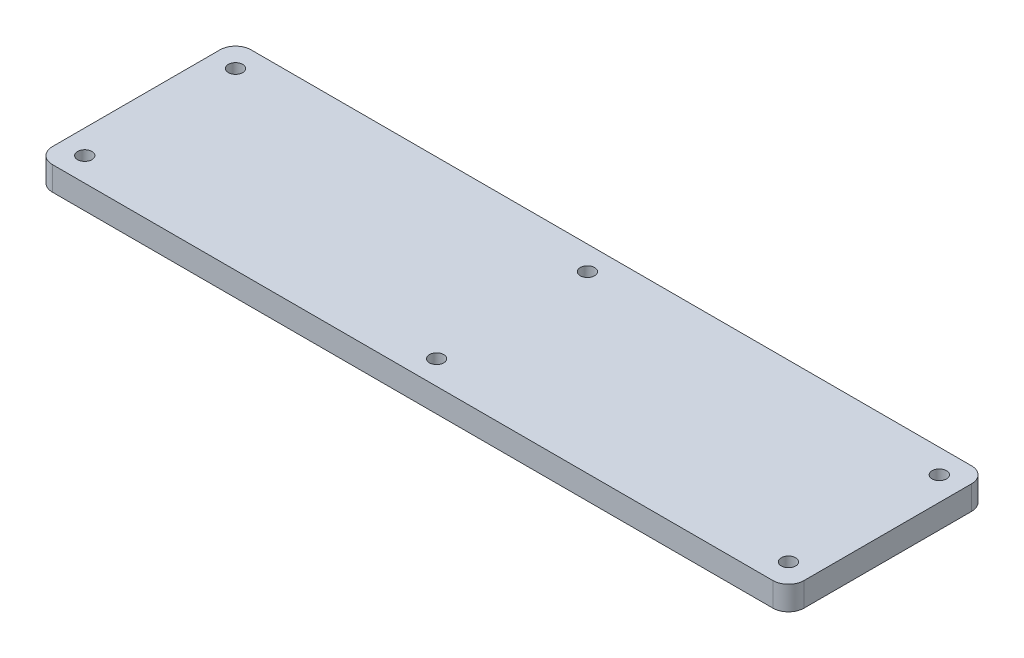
ISO-10303-21;
HEADER;
FILE_DESCRIPTION(('STEP AP214'),'2;1');
FILE_NAME('part.step','',(''),(''),'','','');
FILE_SCHEMA(('AUTOMOTIVE_DESIGN { 1 0 10303 214 1 1 1 1 }'));
ENDSEC;
DATA;
#1=APPLICATION_CONTEXT('core data for automotive mechanical design processes');
#2=APPLICATION_PROTOCOL_DEFINITION('international standard','automotive_design',2000,#1);
#3=PRODUCT_CONTEXT('',#1,'mechanical');
#4=PRODUCT('Part','Part','',(#3));
#5=PRODUCT_RELATED_PRODUCT_CATEGORY('part','',(#4));
#6=PRODUCT_DEFINITION_FORMATION('','',#4);
#7=PRODUCT_DEFINITION_CONTEXT('part definition',#1,'design');
#8=PRODUCT_DEFINITION('design','',#6,#7);
#9=PRODUCT_DEFINITION_SHAPE('','',#8);
#10=(LENGTH_UNIT() NAMED_UNIT(*) SI_UNIT(.MILLI.,.METRE.));
#11=(NAMED_UNIT(*) PLANE_ANGLE_UNIT() SI_UNIT($,.RADIAN.));
#12=(NAMED_UNIT(*) SI_UNIT($,.STERADIAN.) SOLID_ANGLE_UNIT());
#13=UNCERTAINTY_MEASURE_WITH_UNIT(LENGTH_MEASURE(1.E-05),#10,'distance_accuracy_value','');
#14=(GEOMETRIC_REPRESENTATION_CONTEXT(3) GLOBAL_UNCERTAINTY_ASSIGNED_CONTEXT((#13)) GLOBAL_UNIT_ASSIGNED_CONTEXT((#10,
#11,#12)) REPRESENTATION_CONTEXT('',''));
#15=CARTESIAN_POINT('',(0.,0.,0.));
#16=DIRECTION('',(0.,0.,1.));
#17=DIRECTION('',(1.,0.,0.));
#18=AXIS2_PLACEMENT_3D('',#15,#16,#17);
#19=CARTESIAN_POINT('',(-39.878,5.08,-21.082));
#20=DIRECTION('',(0.,0.,1.));
#21=DIRECTION('',(1.,0.,0.));
#22=AXIS2_PLACEMENT_3D('',#19,#20,#21);
#23=PLANE('',#22);
#24=DIRECTION('',(-1.,0.,0.));
#25=VECTOR('',#24,1.);
#26=CARTESIAN_POINT('',(-39.878,5.08,-21.082));
#27=LINE('',#26,#25);
#28=CARTESIAN_POINT('',(116.332,5.08,-21.082));
#29=VERTEX_POINT('',#28);
#30=CARTESIAN_POINT('',(-36.576,5.08,-21.082));
#31=VERTEX_POINT('',#30);
#32=EDGE_CURVE('E130',#29,#31,#27,.T.);
#33=ORIENTED_EDGE('',*,*,#32,.F.);
#34=DIRECTION('',(0.,-1.,0.));
#35=VECTOR('',#34,1.);
#36=CARTESIAN_POINT('',(116.332,0.,-21.082));
#37=LINE('',#36,#35);
#38=CARTESIAN_POINT('',(116.332,0.,-21.082));
#39=VERTEX_POINT('',#38);
#40=EDGE_CURVE('E153',#29,#39,#37,.T.);
#41=ORIENTED_EDGE('',*,*,#40,.T.);
#42=DIRECTION('',(-1.,0.,0.));
#43=VECTOR('',#42,1.);
#44=CARTESIAN_POINT('',(-39.878,0.,-21.082));
#45=LINE('',#44,#43);
#46=CARTESIAN_POINT('',(-36.576,0.,-21.082));
#47=VERTEX_POINT('',#46);
#48=EDGE_CURVE('E128',#39,#47,#45,.T.);
#49=ORIENTED_EDGE('',*,*,#48,.T.);
#50=DIRECTION('',(0.,-1.,0.));
#51=VECTOR('',#50,1.);
#52=CARTESIAN_POINT('',(-36.576,5.08,-21.082));
#53=LINE('',#52,#51);
#54=EDGE_CURVE('E108',#47,#31,#53,.F.);
#55=ORIENTED_EDGE('',*,*,#54,.T.);
#56=EDGE_LOOP('',(#33,#41,#49,#55));
#57=FACE_BOUND('',#56,.T.);
#58=ADVANCED_FACE('F35',(#57),#23,.F.);
#59=CARTESIAN_POINT('',(-39.878,5.08,-21.082));
#60=DIRECTION('',(1.,0.,0.));
#61=DIRECTION('',(0.,0.,-1.));
#62=AXIS2_PLACEMENT_3D('',#59,#60,#61);
#63=PLANE('',#62);
#64=DIRECTION('',(0.,0.,1.));
#65=VECTOR('',#64,1.);
#66=CARTESIAN_POINT('',(-39.878,5.08,-21.082));
#67=LINE('',#66,#65);
#68=CARTESIAN_POINT('',(-39.878,5.08,-17.78));
#69=VERTEX_POINT('',#68);
#70=CARTESIAN_POINT('',(-39.878,5.08,17.78));
#71=VERTEX_POINT('',#70);
#72=EDGE_CURVE('E121',#69,#71,#67,.T.);
#73=ORIENTED_EDGE('',*,*,#72,.F.);
#74=DIRECTION('',(0.,-1.,0.));
#75=VECTOR('',#74,1.);
#76=CARTESIAN_POINT('',(-39.878,5.08,-17.78));
#77=LINE('',#76,#75);
#78=CARTESIAN_POINT('',(-39.878,0.,-17.78));
#79=VERTEX_POINT('',#78);
#80=EDGE_CURVE('E106',#69,#79,#77,.T.);
#81=ORIENTED_EDGE('',*,*,#80,.T.);
#82=DIRECTION('',(0.,0.,1.));
#83=VECTOR('',#82,1.);
#84=CARTESIAN_POINT('',(-39.878,0.,-21.082));
#85=LINE('',#84,#83);
#86=CARTESIAN_POINT('',(-39.878,0.,17.78));
#87=VERTEX_POINT('',#86);
#88=EDGE_CURVE('E118',#79,#87,#85,.T.);
#89=ORIENTED_EDGE('',*,*,#88,.T.);
#90=DIRECTION('',(0.,-1.,0.));
#91=VECTOR('',#90,1.);
#92=CARTESIAN_POINT('',(-39.878,5.08,17.78));
#93=LINE('',#92,#91);
#94=EDGE_CURVE('E122',#87,#71,#93,.F.);
#95=ORIENTED_EDGE('',*,*,#94,.T.);
#96=EDGE_LOOP('',(#73,#81,#89,#95));
#97=FACE_BOUND('',#96,.T.);
#98=ADVANCED_FACE('F117',(#97),#63,.F.);
#99=CARTESIAN_POINT('',(-39.878,5.08,21.082));
#100=DIRECTION('',(0.,0.,-1.));
#101=DIRECTION('',(-1.,0.,0.));
#102=AXIS2_PLACEMENT_3D('',#99,#100,#101);
#103=PLANE('',#102);
#104=DIRECTION('',(1.,0.,0.));
#105=VECTOR('',#104,1.);
#106=CARTESIAN_POINT('',(-39.878,0.,21.082));
#107=LINE('',#106,#105);
#108=CARTESIAN_POINT('',(-36.576,0.,21.082));
#109=VERTEX_POINT('',#108);
#110=CARTESIAN_POINT('',(116.332,0.,21.082));
#111=VERTEX_POINT('',#110);
#112=EDGE_CURVE('E127',#109,#111,#107,.T.);
#113=ORIENTED_EDGE('',*,*,#112,.T.);
#114=DIRECTION('',(0.,-1.,0.));
#115=VECTOR('',#114,1.);
#116=CARTESIAN_POINT('',(116.332,5.08,21.082));
#117=LINE('',#116,#115);
#118=CARTESIAN_POINT('',(116.332,5.08,21.082));
#119=VERTEX_POINT('',#118);
#120=EDGE_CURVE('E11',#111,#119,#117,.F.);
#121=ORIENTED_EDGE('',*,*,#120,.T.);
#122=DIRECTION('',(1.,0.,0.));
#123=VECTOR('',#122,1.);
#124=CARTESIAN_POINT('',(-39.878,5.08,21.082));
#125=LINE('',#124,#123);
#126=CARTESIAN_POINT('',(-36.576,5.08,21.082));
#127=VERTEX_POINT('',#126);
#128=EDGE_CURVE('E136',#127,#119,#125,.T.);
#129=ORIENTED_EDGE('',*,*,#128,.F.);
#130=DIRECTION('',(0.,-1.,0.));
#131=VECTOR('',#130,1.);
#132=CARTESIAN_POINT('',(-36.576,5.08,21.082));
#133=LINE('',#132,#131);
#134=EDGE_CURVE('E144',#127,#109,#133,.T.);
#135=ORIENTED_EDGE('',*,*,#134,.T.);
#136=EDGE_LOOP('',(#113,#121,#129,#135));
#137=FACE_BOUND('',#136,.T.);
#138=ADVANCED_FACE('F210',(#137),#103,.F.);
#139=CARTESIAN_POINT('',(0.,5.08,0.));
#140=DIRECTION('',(0.,1.,0.));
#141=DIRECTION('',(0.,0.,1.));
#142=AXIS2_PLACEMENT_3D('',#139,#140,#141);
#143=PLANE('',#142);
#144=CARTESIAN_POINT('',(114.554,5.08,16.002));
#145=DIRECTION('',(0.,-1.,0.));
#146=DIRECTION('',(0.,0.,1.));
#147=AXIS2_PLACEMENT_3D('',#144,#145,#146);
#148=CIRCLE('',#147,1.524);
#149=CARTESIAN_POINT('',(114.554,5.08,17.526));
#150=VERTEX_POINT('',#149);
#151=EDGE_CURVE('E267',#150,#150,#148,.T.);
#152=ORIENTED_EDGE('',*,*,#151,.T.);
#153=EDGE_LOOP('',(#152));
#154=FACE_BOUND('',#153,.T.);
#155=CARTESIAN_POINT('',(114.554,5.08,-16.002));
#156=DIRECTION('',(0.,-1.,0.));
#157=DIRECTION('',(0.,0.,1.));
#158=AXIS2_PLACEMENT_3D('',#155,#156,#157);
#159=CIRCLE('',#158,1.524);
#160=CARTESIAN_POINT('',(114.554,5.08,-14.478));
#161=VERTEX_POINT('',#160);
#162=EDGE_CURVE('E187',#161,#161,#159,.T.);
#163=ORIENTED_EDGE('',*,*,#162,.T.);
#164=EDGE_LOOP('',(#163));
#165=FACE_BOUND('',#164,.T.);
#166=DIRECTION('',(0.,0.,1.));
#167=VECTOR('',#166,1.);
#168=CARTESIAN_POINT('',(119.634,5.08,-21.082));
#169=LINE('',#168,#167);
#170=CARTESIAN_POINT('',(119.634,5.08,-17.78));
#171=VERTEX_POINT('',#170);
#172=CARTESIAN_POINT('',(119.634,5.08,17.78));
#173=VERTEX_POINT('',#172);
#174=EDGE_CURVE('E169',#171,#173,#169,.T.);
#175=ORIENTED_EDGE('',*,*,#174,.F.);
#176=CARTESIAN_POINT('',(116.332,5.08,-17.78));
#177=DIRECTION('',(0.,1.,0.));
#178=DIRECTION('',(0.,0.,1.));
#179=AXIS2_PLACEMENT_3D('',#176,#177,#178);
#180=CIRCLE('',#179,3.302);
#181=EDGE_CURVE('E43',#171,#29,#180,.T.);
#182=ORIENTED_EDGE('',*,*,#181,.T.);
#183=ORIENTED_EDGE('',*,*,#32,.T.);
#184=CARTESIAN_POINT('',(-36.576,5.08,-17.78));
#185=DIRECTION('',(0.,1.,0.));
#186=DIRECTION('',(0.,0.,1.));
#187=AXIS2_PLACEMENT_3D('',#184,#185,#186);
#188=CIRCLE('',#187,3.302);
#189=EDGE_CURVE('E142',#31,#69,#188,.T.);
#190=ORIENTED_EDGE('',*,*,#189,.T.);
#191=ORIENTED_EDGE('',*,*,#72,.T.);
#192=CARTESIAN_POINT('',(-36.576,5.08,17.78));
#193=DIRECTION('',(0.,1.,0.));
#194=DIRECTION('',(0.,0.,1.));
#195=AXIS2_PLACEMENT_3D('',#192,#193,#194);
#196=CIRCLE('',#195,3.302);
#197=EDGE_CURVE('E140',#71,#127,#196,.T.);
#198=ORIENTED_EDGE('',*,*,#197,.T.);
#199=ORIENTED_EDGE('',*,*,#128,.T.);
#200=CARTESIAN_POINT('',(116.332,5.08,17.78));
#201=DIRECTION('',(0.,1.,0.));
#202=DIRECTION('',(0.,0.,1.));
#203=AXIS2_PLACEMENT_3D('',#200,#201,#202);
#204=CIRCLE('',#203,3.302);
#205=EDGE_CURVE('E55',#119,#173,#204,.T.);
#206=ORIENTED_EDGE('',*,*,#205,.T.);
#207=EDGE_LOOP('',(#175,#182,#183,#190,#191,#198,#199,#206));
#208=FACE_BOUND('',#207,.T.);
#209=CARTESIAN_POINT('',(39.878,5.08,-16.002));
#210=DIRECTION('',(0.,1.,0.));
#211=DIRECTION('',(0.,0.,1.));
#212=AXIS2_PLACEMENT_3D('',#209,#210,#211);
#213=CIRCLE('',#212,1.524);
#214=CARTESIAN_POINT('',(39.878,5.08,-14.478));
#215=VERTEX_POINT('',#214);
#216=EDGE_CURVE('E194',#215,#215,#213,.T.);
#217=ORIENTED_EDGE('',*,*,#216,.F.);
#218=EDGE_LOOP('',(#217));
#219=FACE_BOUND('',#218,.T.);
#220=CARTESIAN_POINT('',(39.878,5.08,16.002));
#221=DIRECTION('',(0.,1.,0.));
#222=DIRECTION('',(0.,0.,1.));
#223=AXIS2_PLACEMENT_3D('',#220,#221,#222);
#224=CIRCLE('',#223,1.524);
#225=CARTESIAN_POINT('',(39.878,5.08,17.526));
#226=VERTEX_POINT('',#225);
#227=EDGE_CURVE('E184',#226,#226,#224,.T.);
#228=ORIENTED_EDGE('',*,*,#227,.F.);
#229=EDGE_LOOP('',(#228));
#230=FACE_BOUND('',#229,.T.);
#231=CARTESIAN_POINT('',(-34.798,5.08,16.002));
#232=DIRECTION('',(0.,1.,0.));
#233=DIRECTION('',(0.,0.,1.));
#234=AXIS2_PLACEMENT_3D('',#231,#232,#233);
#235=CIRCLE('',#234,1.524);
#236=CARTESIAN_POINT('',(-34.798,5.08,17.526));
#237=VERTEX_POINT('',#236);
#238=EDGE_CURVE('E193',#237,#237,#235,.T.);
#239=ORIENTED_EDGE('',*,*,#238,.F.);
#240=EDGE_LOOP('',(#239));
#241=FACE_BOUND('',#240,.T.);
#242=CARTESIAN_POINT('',(-34.798,5.08,-16.002));
#243=DIRECTION('',(0.,1.,0.));
#244=DIRECTION('',(0.,0.,1.));
#245=AXIS2_PLACEMENT_3D('',#242,#243,#244);
#246=CIRCLE('',#245,1.524);
#247=CARTESIAN_POINT('',(-34.798,5.08,-14.478));
#248=VERTEX_POINT('',#247);
#249=EDGE_CURVE('E197',#248,#248,#246,.T.);
#250=ORIENTED_EDGE('',*,*,#249,.F.);
#251=EDGE_LOOP('',(#250));
#252=FACE_BOUND('',#251,.T.);
#253=ADVANCED_FACE('F167',(#154,#165,#208,#219,#230,#241,#252),#143,.T.);
#254=CARTESIAN_POINT('',(0.,0.,0.));
#255=DIRECTION('',(0.,1.,0.));
#256=DIRECTION('',(0.,0.,1.));
#257=AXIS2_PLACEMENT_3D('',#254,#255,#256);
#258=PLANE('',#257);
#259=CARTESIAN_POINT('',(39.878,0.,-16.002));
#260=DIRECTION('',(0.,1.,0.));
#261=DIRECTION('',(0.,0.,1.));
#262=AXIS2_PLACEMENT_3D('',#259,#260,#261);
#263=CIRCLE('',#262,1.524);
#264=CARTESIAN_POINT('',(39.878,0.,-14.478));
#265=VERTEX_POINT('',#264);
#266=EDGE_CURVE('E150',#265,#265,#263,.T.);
#267=ORIENTED_EDGE('',*,*,#266,.T.);
#268=EDGE_LOOP('',(#267));
#269=FACE_BOUND('',#268,.T.);
#270=CARTESIAN_POINT('',(114.554,0.,16.002));
#271=DIRECTION('',(0.,-1.,0.));
#272=DIRECTION('',(0.,0.,1.));
#273=AXIS2_PLACEMENT_3D('',#270,#271,#272);
#274=CIRCLE('',#273,1.524);
#275=CARTESIAN_POINT('',(114.554,0.,17.526));
#276=VERTEX_POINT('',#275);
#277=EDGE_CURVE('E264',#276,#276,#274,.T.);
#278=ORIENTED_EDGE('',*,*,#277,.F.);
#279=EDGE_LOOP('',(#278));
#280=FACE_BOUND('',#279,.T.);
#281=CARTESIAN_POINT('',(39.878,0.,16.002));
#282=DIRECTION('',(0.,1.,0.));
#283=DIRECTION('',(0.,0.,1.));
#284=AXIS2_PLACEMENT_3D('',#281,#282,#283);
#285=CIRCLE('',#284,1.524);
#286=CARTESIAN_POINT('',(39.878,0.,17.526));
#287=VERTEX_POINT('',#286);
#288=EDGE_CURVE('E147',#287,#287,#285,.T.);
#289=ORIENTED_EDGE('',*,*,#288,.T.);
#290=EDGE_LOOP('',(#289));
#291=FACE_BOUND('',#290,.T.);
#292=CARTESIAN_POINT('',(114.554,0.,-16.002));
#293=DIRECTION('',(0.,-1.,0.));
#294=DIRECTION('',(0.,0.,1.));
#295=AXIS2_PLACEMENT_3D('',#292,#293,#294);
#296=CIRCLE('',#295,1.524);
#297=CARTESIAN_POINT('',(114.554,0.,-14.478));
#298=VERTEX_POINT('',#297);
#299=EDGE_CURVE('E182',#298,#298,#296,.T.);
#300=ORIENTED_EDGE('',*,*,#299,.F.);
#301=EDGE_LOOP('',(#300));
#302=FACE_BOUND('',#301,.T.);
#303=ORIENTED_EDGE('',*,*,#48,.F.);
#304=CARTESIAN_POINT('',(116.332,0.,-17.78));
#305=DIRECTION('',(0.,1.,0.));
#306=DIRECTION('',(0.,0.,1.));
#307=AXIS2_PLACEMENT_3D('',#304,#305,#306);
#308=CIRCLE('',#307,3.302);
#309=CARTESIAN_POINT('',(119.634,0.,-17.78));
#310=VERTEX_POINT('',#309);
#311=EDGE_CURVE('E158',#39,#310,#308,.F.);
#312=ORIENTED_EDGE('',*,*,#311,.T.);
#313=DIRECTION('',(0.,0.,1.));
#314=VECTOR('',#313,1.);
#315=CARTESIAN_POINT('',(119.634,0.,-21.082));
#316=LINE('',#315,#314);
#317=CARTESIAN_POINT('',(119.634,0.,17.78));
#318=VERTEX_POINT('',#317);
#319=EDGE_CURVE('E178',#310,#318,#316,.T.);
#320=ORIENTED_EDGE('',*,*,#319,.T.);
#321=CARTESIAN_POINT('',(116.332,0.,17.78));
#322=DIRECTION('',(0.,1.,0.));
#323=DIRECTION('',(0.,0.,1.));
#324=AXIS2_PLACEMENT_3D('',#321,#322,#323);
#325=CIRCLE('',#324,3.302);
#326=EDGE_CURVE('E156',#318,#111,#325,.F.);
#327=ORIENTED_EDGE('',*,*,#326,.T.);
#328=ORIENTED_EDGE('',*,*,#112,.F.);
#329=CARTESIAN_POINT('',(-36.576,0.,17.78));
#330=DIRECTION('',(0.,1.,0.));
#331=DIRECTION('',(0.,0.,1.));
#332=AXIS2_PLACEMENT_3D('',#329,#330,#331);
#333=CIRCLE('',#332,3.302);
#334=EDGE_CURVE('E112',#109,#87,#333,.F.);
#335=ORIENTED_EDGE('',*,*,#334,.T.);
#336=ORIENTED_EDGE('',*,*,#88,.F.);
#337=CARTESIAN_POINT('',(-36.576,0.,-17.78));
#338=DIRECTION('',(0.,1.,0.));
#339=DIRECTION('',(0.,0.,1.));
#340=AXIS2_PLACEMENT_3D('',#337,#338,#339);
#341=CIRCLE('',#340,3.302);
#342=EDGE_CURVE('E102',#79,#47,#341,.F.);
#343=ORIENTED_EDGE('',*,*,#342,.T.);
#344=EDGE_LOOP('',(#303,#312,#320,#327,#328,#335,#336,#343));
#345=FACE_BOUND('',#344,.T.);
#346=CARTESIAN_POINT('',(-34.798,0.,16.002));
#347=DIRECTION('',(0.,1.,0.));
#348=DIRECTION('',(0.,0.,1.));
#349=AXIS2_PLACEMENT_3D('',#346,#347,#348);
#350=CIRCLE('',#349,1.524);
#351=CARTESIAN_POINT('',(-34.798,0.,17.526));
#352=VERTEX_POINT('',#351);
#353=EDGE_CURVE('E198',#352,#352,#350,.T.);
#354=ORIENTED_EDGE('',*,*,#353,.T.);
#355=EDGE_LOOP('',(#354));
#356=FACE_BOUND('',#355,.T.);
#357=CARTESIAN_POINT('',(-34.798,0.,-16.002));
#358=DIRECTION('',(0.,1.,0.));
#359=DIRECTION('',(0.,0.,1.));
#360=AXIS2_PLACEMENT_3D('',#357,#358,#359);
#361=CIRCLE('',#360,1.524);
#362=CARTESIAN_POINT('',(-34.798,0.,-14.478));
#363=VERTEX_POINT('',#362);
#364=EDGE_CURVE('E132',#363,#363,#361,.T.);
#365=ORIENTED_EDGE('',*,*,#364,.T.);
#366=EDGE_LOOP('',(#365));
#367=FACE_BOUND('',#366,.T.);
#368=ADVANCED_FACE('F124',(#269,#280,#291,#302,#345,#356,#367),#258,.F.);
#369=CARTESIAN_POINT('',(-36.576,5.08,-17.78));
#370=DIRECTION('',(0.,-1.,0.));
#371=DIRECTION('',(0.,0.,-1.));
#372=AXIS2_PLACEMENT_3D('',#369,#370,#371);
#373=CYLINDRICAL_SURFACE('',#372,3.302);
#374=ORIENTED_EDGE('',*,*,#189,.F.);
#375=ORIENTED_EDGE('',*,*,#54,.F.);
#376=ORIENTED_EDGE('',*,*,#342,.F.);
#377=ORIENTED_EDGE('',*,*,#80,.F.);
#378=EDGE_LOOP('',(#374,#375,#376,#377));
#379=FACE_BOUND('',#378,.T.);
#380=ADVANCED_FACE('F105',(#379),#373,.T.);
#381=CARTESIAN_POINT('',(-36.576,5.08,17.78));
#382=DIRECTION('',(0.,-1.,0.));
#383=DIRECTION('',(0.,0.,-1.));
#384=AXIS2_PLACEMENT_3D('',#381,#382,#383);
#385=CYLINDRICAL_SURFACE('',#384,3.302);
#386=ORIENTED_EDGE('',*,*,#197,.F.);
#387=ORIENTED_EDGE('',*,*,#94,.F.);
#388=ORIENTED_EDGE('',*,*,#334,.F.);
#389=ORIENTED_EDGE('',*,*,#134,.F.);
#390=EDGE_LOOP('',(#386,#387,#388,#389));
#391=FACE_BOUND('',#390,.T.);
#392=ADVANCED_FACE('F212',(#391),#385,.T.);
#393=CARTESIAN_POINT('',(-34.798,0.,-16.002));
#394=DIRECTION('',(0.,1.,0.));
#395=DIRECTION('',(0.,0.,1.));
#396=AXIS2_PLACEMENT_3D('',#393,#394,#395);
#397=CYLINDRICAL_SURFACE('',#396,1.524);
#398=ORIENTED_EDGE('',*,*,#364,.F.);
#399=EDGE_LOOP('',(#398));
#400=FACE_BOUND('',#399,.T.);
#401=ORIENTED_EDGE('',*,*,#249,.T.);
#402=EDGE_LOOP('',(#401));
#403=FACE_BOUND('',#402,.T.);
#404=ADVANCED_FACE('F214',(#400,#403),#397,.F.);
#405=CARTESIAN_POINT('',(39.878,0.,16.002));
#406=DIRECTION('',(0.,1.,0.));
#407=DIRECTION('',(0.,0.,1.));
#408=AXIS2_PLACEMENT_3D('',#405,#406,#407);
#409=CYLINDRICAL_SURFACE('',#408,1.524);
#410=ORIENTED_EDGE('',*,*,#227,.T.);
#411=EDGE_LOOP('',(#410));
#412=FACE_BOUND('',#411,.T.);
#413=ORIENTED_EDGE('',*,*,#288,.F.);
#414=EDGE_LOOP('',(#413));
#415=FACE_BOUND('',#414,.T.);
#416=ADVANCED_FACE('F220',(#412,#415),#409,.F.);
#417=CARTESIAN_POINT('',(-34.798,0.,16.002));
#418=DIRECTION('',(0.,1.,0.));
#419=DIRECTION('',(0.,0.,1.));
#420=AXIS2_PLACEMENT_3D('',#417,#418,#419);
#421=CYLINDRICAL_SURFACE('',#420,1.524);
#422=ORIENTED_EDGE('',*,*,#353,.F.);
#423=EDGE_LOOP('',(#422));
#424=FACE_BOUND('',#423,.T.);
#425=ORIENTED_EDGE('',*,*,#238,.T.);
#426=EDGE_LOOP('',(#425));
#427=FACE_BOUND('',#426,.T.);
#428=ADVANCED_FACE('F239',(#424,#427),#421,.F.);
#429=CARTESIAN_POINT('',(39.878,0.,-16.002));
#430=DIRECTION('',(0.,1.,0.));
#431=DIRECTION('',(0.,0.,1.));
#432=AXIS2_PLACEMENT_3D('',#429,#430,#431);
#433=CYLINDRICAL_SURFACE('',#432,1.524);
#434=ORIENTED_EDGE('',*,*,#216,.T.);
#435=EDGE_LOOP('',(#434));
#436=FACE_BOUND('',#435,.T.);
#437=ORIENTED_EDGE('',*,*,#266,.F.);
#438=EDGE_LOOP('',(#437));
#439=FACE_BOUND('',#438,.T.);
#440=ADVANCED_FACE('F242',(#436,#439),#433,.F.);
#441=CARTESIAN_POINT('',(119.634,5.08,-21.082));
#442=DIRECTION('',(1.,0.,0.));
#443=DIRECTION('',(0.,0.,-1.));
#444=AXIS2_PLACEMENT_3D('',#441,#442,#443);
#445=PLANE('',#444);
#446=ORIENTED_EDGE('',*,*,#319,.F.);
#447=DIRECTION('',(0.,-1.,0.));
#448=VECTOR('',#447,1.);
#449=CARTESIAN_POINT('',(119.634,5.08,-17.78));
#450=LINE('',#449,#448);
#451=EDGE_CURVE('E163',#310,#171,#450,.F.);
#452=ORIENTED_EDGE('',*,*,#451,.T.);
#453=ORIENTED_EDGE('',*,*,#174,.T.);
#454=DIRECTION('',(0.,-1.,0.));
#455=VECTOR('',#454,1.);
#456=CARTESIAN_POINT('',(119.634,0.,17.78));
#457=LINE('',#456,#455);
#458=EDGE_CURVE('E160',#173,#318,#457,.T.);
#459=ORIENTED_EDGE('',*,*,#458,.T.);
#460=EDGE_LOOP('',(#446,#452,#453,#459));
#461=FACE_BOUND('',#460,.T.);
#462=ADVANCED_FACE('F180',(#461),#445,.T.);
#463=CARTESIAN_POINT('',(116.332,5.08,-17.78));
#464=DIRECTION('',(0.,1.,0.));
#465=DIRECTION('',(0.,0.,1.));
#466=AXIS2_PLACEMENT_3D('',#463,#464,#465);
#467=CYLINDRICAL_SURFACE('',#466,3.302);
#468=ORIENTED_EDGE('',*,*,#181,.F.);
#469=ORIENTED_EDGE('',*,*,#451,.F.);
#470=ORIENTED_EDGE('',*,*,#311,.F.);
#471=ORIENTED_EDGE('',*,*,#40,.F.);
#472=EDGE_LOOP('',(#468,#469,#470,#471));
#473=FACE_BOUND('',#472,.T.);
#474=ADVANCED_FACE('F175',(#473),#467,.T.);
#475=CARTESIAN_POINT('',(116.332,5.08,17.78));
#476=DIRECTION('',(0.,1.,0.));
#477=DIRECTION('',(0.,0.,1.));
#478=AXIS2_PLACEMENT_3D('',#475,#476,#477);
#479=CYLINDRICAL_SURFACE('',#478,3.302);
#480=ORIENTED_EDGE('',*,*,#205,.F.);
#481=ORIENTED_EDGE('',*,*,#120,.F.);
#482=ORIENTED_EDGE('',*,*,#326,.F.);
#483=ORIENTED_EDGE('',*,*,#458,.F.);
#484=EDGE_LOOP('',(#480,#481,#482,#483));
#485=FACE_BOUND('',#484,.T.);
#486=ADVANCED_FACE('F37',(#485),#479,.T.);
#487=CARTESIAN_POINT('',(114.554,0.,-16.002));
#488=DIRECTION('',(0.,1.,0.));
#489=DIRECTION('',(0.,0.,1.));
#490=AXIS2_PLACEMENT_3D('',#487,#488,#489);
#491=CYLINDRICAL_SURFACE('',#490,1.524);
#492=ORIENTED_EDGE('',*,*,#299,.T.);
#493=EDGE_LOOP('',(#492));
#494=FACE_BOUND('',#493,.T.);
#495=ORIENTED_EDGE('',*,*,#162,.F.);
#496=EDGE_LOOP('',(#495));
#497=FACE_BOUND('',#496,.T.);
#498=ADVANCED_FACE('F252',(#494,#497),#491,.F.);
#499=CARTESIAN_POINT('',(114.554,0.,16.002));
#500=DIRECTION('',(0.,1.,0.));
#501=DIRECTION('',(0.,0.,1.));
#502=AXIS2_PLACEMENT_3D('',#499,#500,#501);
#503=CYLINDRICAL_SURFACE('',#502,1.524);
#504=ORIENTED_EDGE('',*,*,#277,.T.);
#505=EDGE_LOOP('',(#504));
#506=FACE_BOUND('',#505,.T.);
#507=ORIENTED_EDGE('',*,*,#151,.F.);
#508=EDGE_LOOP('',(#507));
#509=FACE_BOUND('',#508,.T.);
#510=ADVANCED_FACE('F255',(#506,#509),#503,.F.);
#511=CLOSED_SHELL('',(#58,#98,#138,#253,#368,#380,#392,#404,#416,#428,#440,#462,#474,#486,#498,#510));
#512=MANIFOLD_SOLID_BREP('B2',#511);
#513=ADVANCED_BREP_SHAPE_REPRESENTATION('',(#18,#512),#14);
#514=SHAPE_DEFINITION_REPRESENTATION(#9,#513);
ENDSEC;
END-ISO-10303-21;
